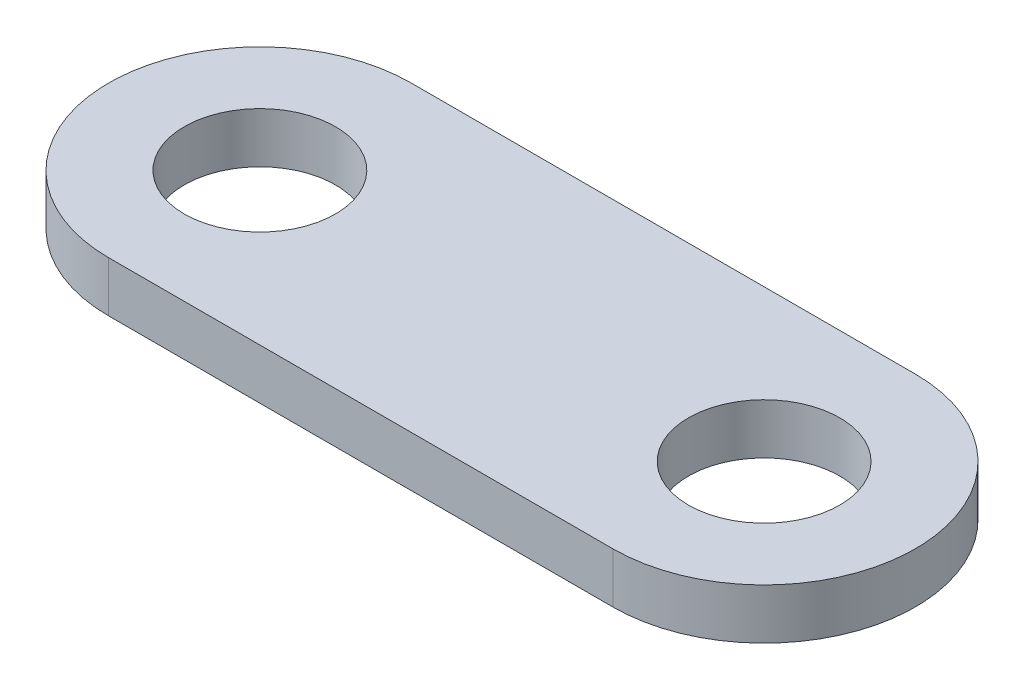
ISO-10303-21;
HEADER;
FILE_DESCRIPTION(('STEP AP214'),'2;1');
FILE_NAME('part.step','',(''),(''),'','','');
FILE_SCHEMA(('AUTOMOTIVE_DESIGN { 1 0 10303 214 1 1 1 1 }'));
ENDSEC;
DATA;
#1=APPLICATION_CONTEXT('core data for automotive mechanical design processes');
#2=APPLICATION_PROTOCOL_DEFINITION('international standard','automotive_design',2000,#1);
#3=PRODUCT_CONTEXT('',#1,'mechanical');
#4=PRODUCT('Part','Part','',(#3));
#5=PRODUCT_RELATED_PRODUCT_CATEGORY('part','',(#4));
#6=PRODUCT_DEFINITION_FORMATION('','',#4);
#7=PRODUCT_DEFINITION_CONTEXT('part definition',#1,'design');
#8=PRODUCT_DEFINITION('design','',#6,#7);
#9=PRODUCT_DEFINITION_SHAPE('','',#8);
#10=(LENGTH_UNIT() NAMED_UNIT(*) SI_UNIT(.MILLI.,.METRE.));
#11=(NAMED_UNIT(*) PLANE_ANGLE_UNIT() SI_UNIT($,.RADIAN.));
#12=(NAMED_UNIT(*) SI_UNIT($,.STERADIAN.) SOLID_ANGLE_UNIT());
#13=UNCERTAINTY_MEASURE_WITH_UNIT(LENGTH_MEASURE(1.E-05),#10,'distance_accuracy_value','');
#14=(GEOMETRIC_REPRESENTATION_CONTEXT(3) GLOBAL_UNCERTAINTY_ASSIGNED_CONTEXT((#13)) GLOBAL_UNIT_ASSIGNED_CONTEXT((#10,
#11,#12)) REPRESENTATION_CONTEXT('',''));
#15=CARTESIAN_POINT('',(0.,0.,0.));
#16=DIRECTION('',(0.,0.,1.));
#17=DIRECTION('',(1.,0.,0.));
#18=AXIS2_PLACEMENT_3D('',#15,#16,#17);
#19=CARTESIAN_POINT('',(0.,5.,-15.));
#20=DIRECTION('',(0.,1.,0.));
#21=DIRECTION('',(0.,0.,1.));
#22=AXIS2_PLACEMENT_3D('',#19,#20,#21);
#23=PLANE('',#22);
#24=CARTESIAN_POINT('',(50.,5.,-15.));
#25=DIRECTION('',(0.,1.,0.));
#26=DIRECTION('',(0.,0.,1.));
#27=AXIS2_PLACEMENT_3D('',#24,#25,#26);
#28=CIRCLE('',#27,7.5);
#29=CARTESIAN_POINT('',(50.,5.,-7.5));
#30=VERTEX_POINT('',#29);
#31=EDGE_CURVE('E88',#30,#30,#28,.T.);
#32=ORIENTED_EDGE('',*,*,#31,.F.);
#33=EDGE_LOOP('',(#32));
#34=FACE_BOUND('',#33,.T.);
#35=CARTESIAN_POINT('',(0.,5.,-15.));
#36=DIRECTION('',(0.,1.,0.));
#37=DIRECTION('',(0.,0.,1.));
#38=AXIS2_PLACEMENT_3D('',#35,#36,#37);
#39=CIRCLE('',#38,15.);
#40=CARTESIAN_POINT('',(0.,5.,-30.));
#41=VERTEX_POINT('',#40);
#42=CARTESIAN_POINT('',(0.,5.,0.));
#43=VERTEX_POINT('',#42);
#44=EDGE_CURVE('E98',#41,#43,#39,.T.);
#45=ORIENTED_EDGE('',*,*,#44,.T.);
#46=DIRECTION('',(1.,0.,0.));
#47=VECTOR('',#46,1.);
#48=CARTESIAN_POINT('',(0.,5.,0.));
#49=LINE('',#48,#47);
#50=CARTESIAN_POINT('',(50.,5.,0.));
#51=VERTEX_POINT('',#50);
#52=EDGE_CURVE('E83',#43,#51,#49,.T.);
#53=ORIENTED_EDGE('',*,*,#52,.T.);
#54=CARTESIAN_POINT('',(50.,5.,-15.));
#55=DIRECTION('',(0.,1.,0.));
#56=DIRECTION('',(0.,0.,1.));
#57=AXIS2_PLACEMENT_3D('',#54,#55,#56);
#58=CIRCLE('',#57,15.);
#59=CARTESIAN_POINT('',(50.,5.,-30.));
#60=VERTEX_POINT('',#59);
#61=EDGE_CURVE('E49',#51,#60,#58,.T.);
#62=ORIENTED_EDGE('',*,*,#61,.T.);
#63=DIRECTION('',(-1.,0.,0.));
#64=VECTOR('',#63,1.);
#65=CARTESIAN_POINT('',(50.,5.,-30.));
#66=LINE('',#65,#64);
#67=EDGE_CURVE('E44',#60,#41,#66,.T.);
#68=ORIENTED_EDGE('',*,*,#67,.T.);
#69=EDGE_LOOP('',(#45,#53,#62,#68));
#70=FACE_BOUND('',#69,.T.);
#71=CARTESIAN_POINT('',(0.,5.,-15.));
#72=DIRECTION('',(0.,1.,0.));
#73=DIRECTION('',(0.,0.,1.));
#74=AXIS2_PLACEMENT_3D('',#71,#72,#73);
#75=CIRCLE('',#74,7.5);
#76=CARTESIAN_POINT('',(0.,5.,-7.5));
#77=VERTEX_POINT('',#76);
#78=EDGE_CURVE('E116',#77,#77,#75,.T.);
#79=ORIENTED_EDGE('',*,*,#78,.F.);
#80=EDGE_LOOP('',(#79));
#81=FACE_BOUND('',#80,.T.);
#82=ADVANCED_FACE('F29',(#34,#70,#81),#23,.T.);
#83=CARTESIAN_POINT('',(0.,0.,-15.));
#84=DIRECTION('',(0.,1.,0.));
#85=DIRECTION('',(0.,0.,1.));
#86=AXIS2_PLACEMENT_3D('',#83,#84,#85);
#87=PLANE('',#86);
#88=CARTESIAN_POINT('',(50.,0.,-15.));
#89=DIRECTION('',(0.,1.,0.));
#90=DIRECTION('',(0.,0.,1.));
#91=AXIS2_PLACEMENT_3D('',#88,#89,#90);
#92=CIRCLE('',#91,7.5);
#93=CARTESIAN_POINT('',(50.,0.,-7.5));
#94=VERTEX_POINT('',#93);
#95=EDGE_CURVE('E91',#94,#94,#92,.T.);
#96=ORIENTED_EDGE('',*,*,#95,.T.);
#97=EDGE_LOOP('',(#96));
#98=FACE_BOUND('',#97,.T.);
#99=CARTESIAN_POINT('',(0.,0.,-15.));
#100=DIRECTION('',(0.,1.,0.));
#101=DIRECTION('',(0.,0.,1.));
#102=AXIS2_PLACEMENT_3D('',#99,#100,#101);
#103=CIRCLE('',#102,15.);
#104=CARTESIAN_POINT('',(0.,0.,-30.));
#105=VERTEX_POINT('',#104);
#106=CARTESIAN_POINT('',(0.,0.,0.));
#107=VERTEX_POINT('',#106);
#108=EDGE_CURVE('E75',#105,#107,#103,.T.);
#109=ORIENTED_EDGE('',*,*,#108,.F.);
#110=DIRECTION('',(-1.,0.,0.));
#111=VECTOR('',#110,1.);
#112=CARTESIAN_POINT('',(50.,0.,-30.));
#113=LINE('',#112,#111);
#114=CARTESIAN_POINT('',(50.,0.,-30.));
#115=VERTEX_POINT('',#114);
#116=EDGE_CURVE('E96',#115,#105,#113,.T.);
#117=ORIENTED_EDGE('',*,*,#116,.F.);
#118=CARTESIAN_POINT('',(50.,0.,-15.));
#119=DIRECTION('',(0.,1.,0.));
#120=DIRECTION('',(0.,0.,1.));
#121=AXIS2_PLACEMENT_3D('',#118,#119,#120);
#122=CIRCLE('',#121,15.);
#123=CARTESIAN_POINT('',(50.,0.,0.));
#124=VERTEX_POINT('',#123);
#125=EDGE_CURVE('E76',#124,#115,#122,.T.);
#126=ORIENTED_EDGE('',*,*,#125,.F.);
#127=DIRECTION('',(1.,0.,0.));
#128=VECTOR('',#127,1.);
#129=CARTESIAN_POINT('',(0.,0.,0.));
#130=LINE('',#129,#128);
#131=EDGE_CURVE('E70',#107,#124,#130,.T.);
#132=ORIENTED_EDGE('',*,*,#131,.F.);
#133=EDGE_LOOP('',(#109,#117,#126,#132));
#134=FACE_BOUND('',#133,.T.);
#135=CARTESIAN_POINT('',(0.,0.,-15.));
#136=DIRECTION('',(0.,1.,0.));
#137=DIRECTION('',(0.,0.,1.));
#138=AXIS2_PLACEMENT_3D('',#135,#136,#137);
#139=CIRCLE('',#138,7.5);
#140=CARTESIAN_POINT('',(0.,0.,-7.5));
#141=VERTEX_POINT('',#140);
#142=EDGE_CURVE('E118',#141,#141,#139,.T.);
#143=ORIENTED_EDGE('',*,*,#142,.T.);
#144=EDGE_LOOP('',(#143));
#145=FACE_BOUND('',#144,.T.);
#146=ADVANCED_FACE('F71',(#98,#134,#145),#87,.F.);
#147=CARTESIAN_POINT('',(0.,5.,-15.));
#148=DIRECTION('',(0.,-1.,0.));
#149=DIRECTION('',(0.,0.,-1.));
#150=AXIS2_PLACEMENT_3D('',#147,#148,#149);
#151=CYLINDRICAL_SURFACE('',#150,15.);
#152=ORIENTED_EDGE('',*,*,#108,.T.);
#153=DIRECTION('',(0.,-1.,0.));
#154=VECTOR('',#153,1.);
#155=CARTESIAN_POINT('',(0.,5.,0.));
#156=LINE('',#155,#154);
#157=EDGE_CURVE('E11',#43,#107,#156,.T.);
#158=ORIENTED_EDGE('',*,*,#157,.F.);
#159=ORIENTED_EDGE('',*,*,#44,.F.);
#160=DIRECTION('',(0.,-1.,0.));
#161=VECTOR('',#160,1.);
#162=CARTESIAN_POINT('',(0.,5.,-30.));
#163=LINE('',#162,#161);
#164=EDGE_CURVE('E87',#41,#105,#163,.T.);
#165=ORIENTED_EDGE('',*,*,#164,.T.);
#166=EDGE_LOOP('',(#152,#158,#159,#165));
#167=FACE_BOUND('',#166,.T.);
#168=ADVANCED_FACE('F31',(#167),#151,.T.);
#169=CARTESIAN_POINT('',(0.,5.,0.));
#170=DIRECTION('',(0.,0.,-1.));
#171=DIRECTION('',(-1.,0.,0.));
#172=AXIS2_PLACEMENT_3D('',#169,#170,#171);
#173=PLANE('',#172);
#174=ORIENTED_EDGE('',*,*,#131,.T.);
#175=DIRECTION('',(0.,-1.,0.));
#176=VECTOR('',#175,1.);
#177=CARTESIAN_POINT('',(50.,5.,0.));
#178=LINE('',#177,#176);
#179=EDGE_CURVE('E37',#51,#124,#178,.T.);
#180=ORIENTED_EDGE('',*,*,#179,.F.);
#181=ORIENTED_EDGE('',*,*,#52,.F.);
#182=ORIENTED_EDGE('',*,*,#157,.T.);
#183=EDGE_LOOP('',(#174,#180,#181,#182));
#184=FACE_BOUND('',#183,.T.);
#185=ADVANCED_FACE('F82',(#184),#173,.F.);
#186=CARTESIAN_POINT('',(50.,5.,-15.));
#187=DIRECTION('',(0.,-1.,0.));
#188=DIRECTION('',(0.,0.,-1.));
#189=AXIS2_PLACEMENT_3D('',#186,#187,#188);
#190=CYLINDRICAL_SURFACE('',#189,15.);
#191=ORIENTED_EDGE('',*,*,#125,.T.);
#192=DIRECTION('',(0.,-1.,0.));
#193=VECTOR('',#192,1.);
#194=CARTESIAN_POINT('',(50.,5.,-30.));
#195=LINE('',#194,#193);
#196=EDGE_CURVE('E104',#60,#115,#195,.T.);
#197=ORIENTED_EDGE('',*,*,#196,.F.);
#198=ORIENTED_EDGE('',*,*,#61,.F.);
#199=ORIENTED_EDGE('',*,*,#179,.T.);
#200=EDGE_LOOP('',(#191,#197,#198,#199));
#201=FACE_BOUND('',#200,.T.);
#202=ADVANCED_FACE('F107',(#201),#190,.T.);
#203=CARTESIAN_POINT('',(50.,5.,-30.));
#204=DIRECTION('',(0.,0.,1.));
#205=DIRECTION('',(1.,0.,0.));
#206=AXIS2_PLACEMENT_3D('',#203,#204,#205);
#207=PLANE('',#206);
#208=ORIENTED_EDGE('',*,*,#116,.T.);
#209=ORIENTED_EDGE('',*,*,#164,.F.);
#210=ORIENTED_EDGE('',*,*,#67,.F.);
#211=ORIENTED_EDGE('',*,*,#196,.T.);
#212=EDGE_LOOP('',(#208,#209,#210,#211));
#213=FACE_BOUND('',#212,.T.);
#214=ADVANCED_FACE('F109',(#213),#207,.F.);
#215=CARTESIAN_POINT('',(50.,5.,-15.));
#216=DIRECTION('',(0.,-1.,0.));
#217=DIRECTION('',(0.,0.,-1.));
#218=AXIS2_PLACEMENT_3D('',#215,#216,#217);
#219=CYLINDRICAL_SURFACE('',#218,7.5);
#220=ORIENTED_EDGE('',*,*,#31,.T.);
#221=EDGE_LOOP('',(#220));
#222=FACE_BOUND('',#221,.T.);
#223=ORIENTED_EDGE('',*,*,#95,.F.);
#224=EDGE_LOOP('',(#223));
#225=FACE_BOUND('',#224,.T.);
#226=ADVANCED_FACE('F127',(#222,#225),#219,.F.);
#227=CARTESIAN_POINT('',(0.,5.,-15.));
#228=DIRECTION('',(0.,-1.,0.));
#229=DIRECTION('',(0.,0.,-1.));
#230=AXIS2_PLACEMENT_3D('',#227,#228,#229);
#231=CYLINDRICAL_SURFACE('',#230,7.5);
#232=ORIENTED_EDGE('',*,*,#78,.T.);
#233=EDGE_LOOP('',(#232));
#234=FACE_BOUND('',#233,.T.);
#235=ORIENTED_EDGE('',*,*,#142,.F.);
#236=EDGE_LOOP('',(#235));
#237=FACE_BOUND('',#236,.T.);
#238=ADVANCED_FACE('F125',(#234,#237),#231,.F.);
#239=CLOSED_SHELL('',(#82,#146,#168,#185,#202,#214,#226,#238));
#240=MANIFOLD_SOLID_BREP('B2',#239);
#241=ADVANCED_BREP_SHAPE_REPRESENTATION('',(#18,#240),#14);
#242=SHAPE_DEFINITION_REPRESENTATION(#9,#241);
ENDSEC;
END-ISO-10303-21;
